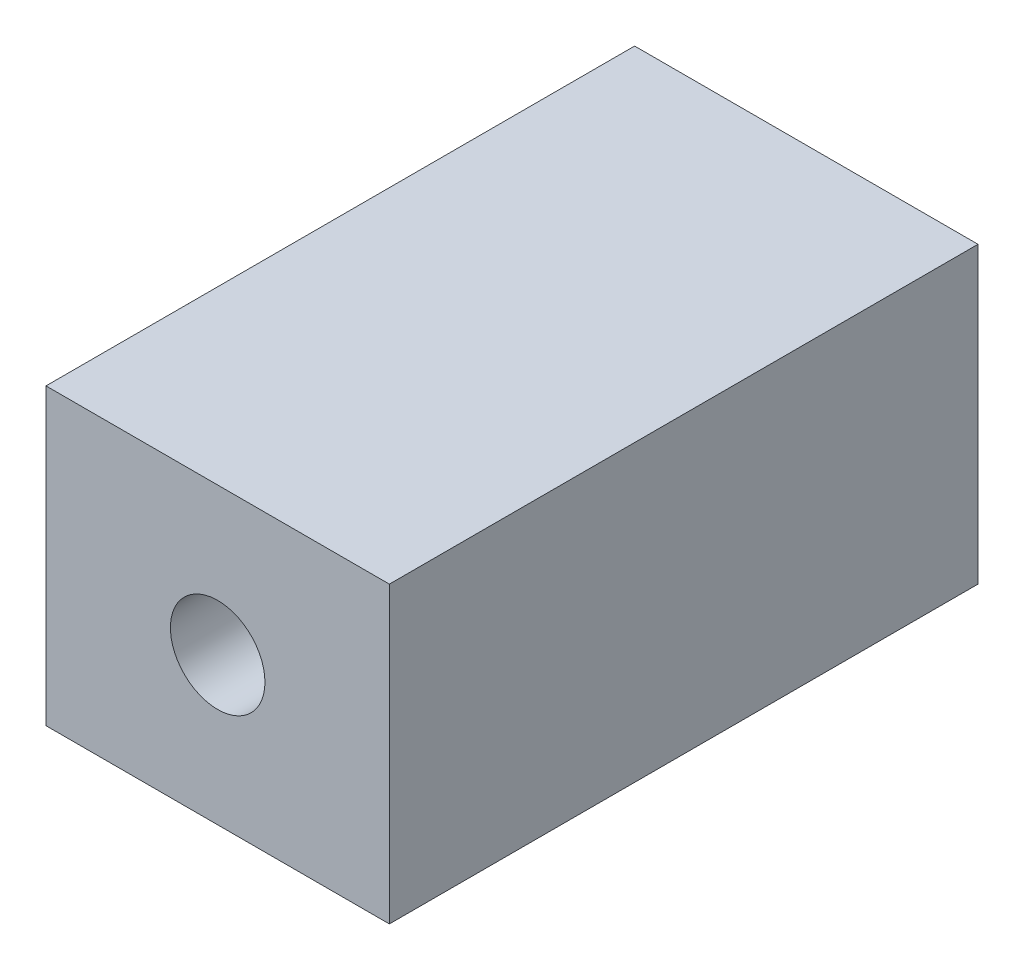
from build123d import *

# Parameters (mm, degrees)
L_U_BR_W                  = 7
L_U_BR_H                  = 12
AUFSATZ_LIN_GK_DEPTH      = 3
LOCH_01_R                 = 0.96353193
SCHNITT_LIN_LOCH_01_DEPTH = 8.566372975
LOCH_02_R                 = 1.167487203
SCHNITT_LIN_LOCH_02_DEPTH = 8.566372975


with BuildPart() as part:
    # L_ u Br → Aufsatz-Lin_GK (new, symmetric)
    with BuildSketch(Plane(origin=(0, 0, 0), x_dir=(1, 0, 0), z_dir=(0, 1, 0))):
        Rectangle(L_U_BR_W, L_U_BR_H)
    extrude(amount=AUFSATZ_LIN_GK_DEPTH, both=True)

    # Loch 01 → Schnitt-Lin_Loch 01 (cut, through all)
    with BuildSketch(Plane.XY):
        Circle(LOCH_01_R)
    extrude(amount=SCHNITT_LIN_LOCH_01_DEPTH, mode=Mode.SUBTRACT)

    # Loch 02 → Schnitt-Lin_Loch 02 (cut, through all)
    with BuildSketch(Plane.XY):
        Circle(LOCH_02_R)
    extrude(amount=-SCHNITT_LIN_LOCH_02_DEPTH, mode=Mode.SUBTRACT)


solid = part.part
